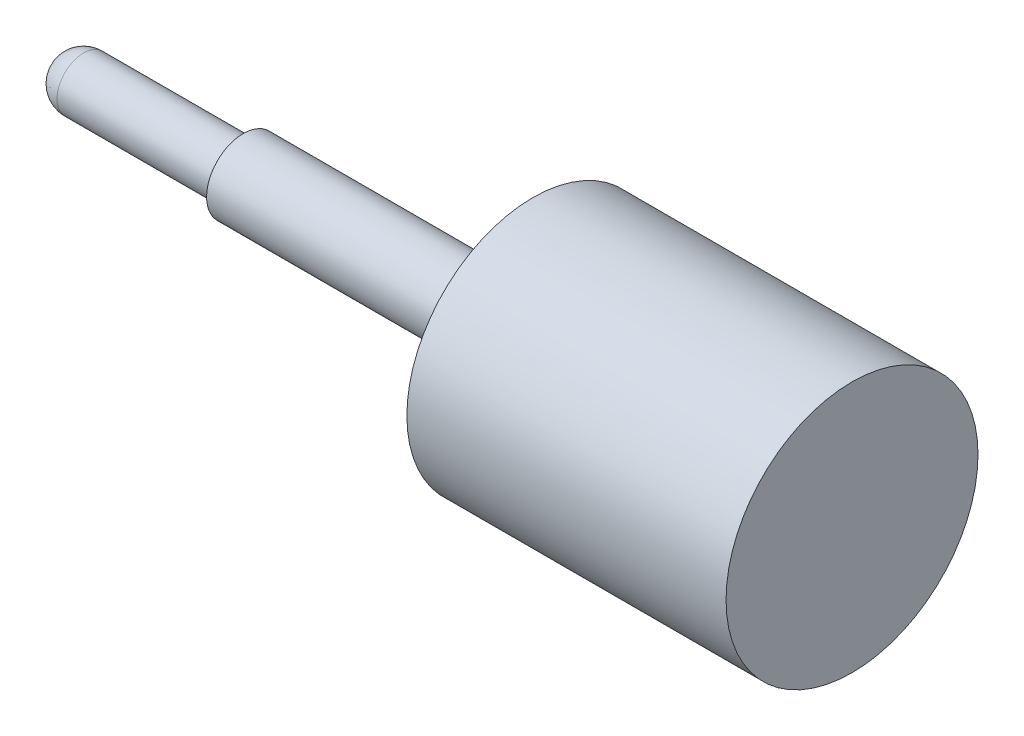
ISO-10303-21;
HEADER;
FILE_DESCRIPTION(('STEP AP214'),'2;1');
FILE_NAME('part.step','',(''),(''),'','','');
FILE_SCHEMA(('AUTOMOTIVE_DESIGN { 1 0 10303 214 1 1 1 1 }'));
ENDSEC;
DATA;
#1=APPLICATION_CONTEXT('core data for automotive mechanical design processes');
#2=APPLICATION_PROTOCOL_DEFINITION('international standard','automotive_design',2000,#1);
#3=PRODUCT_CONTEXT('',#1,'mechanical');
#4=PRODUCT('Part','Part','',(#3));
#5=PRODUCT_RELATED_PRODUCT_CATEGORY('part','',(#4));
#6=PRODUCT_DEFINITION_FORMATION('','',#4);
#7=PRODUCT_DEFINITION_CONTEXT('part definition',#1,'design');
#8=PRODUCT_DEFINITION('design','',#6,#7);
#9=PRODUCT_DEFINITION_SHAPE('','',#8);
#10=(LENGTH_UNIT() NAMED_UNIT(*) SI_UNIT(.MILLI.,.METRE.));
#11=(NAMED_UNIT(*) PLANE_ANGLE_UNIT() SI_UNIT($,.RADIAN.));
#12=(NAMED_UNIT(*) SI_UNIT($,.STERADIAN.) SOLID_ANGLE_UNIT());
#13=UNCERTAINTY_MEASURE_WITH_UNIT(LENGTH_MEASURE(1.E-05),#10,'distance_accuracy_value','');
#14=(GEOMETRIC_REPRESENTATION_CONTEXT(3) GLOBAL_UNCERTAINTY_ASSIGNED_CONTEXT((#13)) GLOBAL_UNIT_ASSIGNED_CONTEXT((#10,
#11,#12)) REPRESENTATION_CONTEXT('',''));
#15=CARTESIAN_POINT('',(0.,0.,0.));
#16=DIRECTION('',(0.,0.,1.));
#17=DIRECTION('',(1.,0.,0.));
#18=AXIS2_PLACEMENT_3D('',#15,#16,#17);
#19=CARTESIAN_POINT('',(-30.000000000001,-325.000000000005,0.));
#20=DIRECTION('',(0.,-1.,0.));
#21=DIRECTION('',(1.,0.,0.));
#22=AXIS2_PLACEMENT_3D('',#19,#20,#21);
#23=SPHERICAL_SURFACE('',#22,12.7);
#24=CARTESIAN_POINT('',(-30.000000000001,-325.000000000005,0.));
#25=DIRECTION('',(-1.,0.,0.));
#26=DIRECTION('',(0.,-1.,0.));
#27=AXIS2_PLACEMENT_3D('',#24,#25,#26);
#28=CIRCLE('',#27,12.7);
#29=CARTESIAN_POINT('',(-30.000000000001,-312.300000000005,0.));
#30=VERTEX_POINT('',#29);
#31=CARTESIAN_POINT('',(-30.000000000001,-337.700000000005,0.));
#32=VERTEX_POINT('',#31);
#33=EDGE_CURVE('E32',#30,#32,#28,.F.);
#34=ORIENTED_EDGE('',*,*,#33,.F.);
#35=CARTESIAN_POINT('',(-30.000000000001,-325.000000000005,0.));
#36=DIRECTION('',(-1.,0.,0.));
#37=DIRECTION('',(0.,-1.,0.));
#38=AXIS2_PLACEMENT_3D('',#35,#36,#37);
#39=CIRCLE('',#38,12.7);
#40=EDGE_CURVE('E35',#32,#30,#39,.F.);
#41=ORIENTED_EDGE('',*,*,#40,.F.);
#42=EDGE_LOOP('',(#34,#41));
#43=FACE_BOUND('',#42,.T.);
#44=ADVANCED_FACE('F16',(#43),#23,.T.);
#45=CARTESIAN_POINT('',(-42.700000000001,-325.000000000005,0.));
#46=DIRECTION('',(-1.,0.,0.));
#47=DIRECTION('',(0.,-1.,0.));
#48=AXIS2_PLACEMENT_3D('',#45,#46,#47);
#49=CYLINDRICAL_SURFACE('',#48,12.7);
#50=CARTESIAN_POINT('',(46.199999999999,-325.000000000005,0.));
#51=DIRECTION('',(-1.,0.,0.));
#52=DIRECTION('',(0.,-1.,0.));
#53=AXIS2_PLACEMENT_3D('',#50,#51,#52);
#54=CIRCLE('',#53,12.7);
#55=CARTESIAN_POINT('',(46.199999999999,-337.700000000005,0.));
#56=VERTEX_POINT('',#55);
#57=EDGE_CURVE('E20',#56,#56,#54,.F.);
#58=ORIENTED_EDGE('',*,*,#57,.F.);
#59=EDGE_LOOP('',(#58));
#60=FACE_BOUND('',#59,.T.);
#61=ORIENTED_EDGE('',*,*,#40,.T.);
#62=ORIENTED_EDGE('',*,*,#33,.T.);
#63=EDGE_LOOP('',(#61,#62));
#64=FACE_BOUND('',#63,.T.);
#65=ADVANCED_FACE('F37',(#60,#64),#49,.T.);
#66=CARTESIAN_POINT('',(46.199999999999,-337.700000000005,0.));
#67=DIRECTION('',(-1.,0.,0.));
#68=DIRECTION('',(0.,-1.,0.));
#69=AXIS2_PLACEMENT_3D('',#66,#67,#68);
#70=PLANE('',#69);
#71=ORIENTED_EDGE('',*,*,#57,.T.);
#72=EDGE_LOOP('',(#71));
#73=FACE_BOUND('',#72,.T.);
#74=CARTESIAN_POINT('',(46.199999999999,-325.000000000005,0.));
#75=DIRECTION('',(-1.,0.,0.));
#76=DIRECTION('',(0.,-1.,0.));
#77=AXIS2_PLACEMENT_3D('',#74,#75,#76);
#78=CIRCLE('',#77,17.4752);
#79=CARTESIAN_POINT('',(46.199999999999,-342.475200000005,0.));
#80=VERTEX_POINT('',#79);
#81=EDGE_CURVE('E40',#80,#80,#78,.F.);
#82=ORIENTED_EDGE('',*,*,#81,.F.);
#83=EDGE_LOOP('',(#82));
#84=FACE_BOUND('',#83,.T.);
#85=ADVANCED_FACE('F56',(#73,#84),#70,.T.);
#86=CARTESIAN_POINT('',(-42.700000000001,-325.000000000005,0.));
#87=DIRECTION('',(-1.,0.,0.));
#88=DIRECTION('',(0.,-1.,0.));
#89=AXIS2_PLACEMENT_3D('',#86,#87,#88);
#90=CYLINDRICAL_SURFACE('',#89,17.4752);
#91=ORIENTED_EDGE('',*,*,#81,.T.);
#92=EDGE_LOOP('',(#91));
#93=FACE_BOUND('',#92,.T.);
#94=CARTESIAN_POINT('',(184.5,-325.000000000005,0.));
#95=DIRECTION('',(-1.,0.,0.));
#96=DIRECTION('',(0.,-1.,0.));
#97=AXIS2_PLACEMENT_3D('',#94,#95,#96);
#98=CIRCLE('',#97,17.4752);
#99=CARTESIAN_POINT('',(184.5,-342.475200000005,0.));
#100=VERTEX_POINT('',#99);
#101=EDGE_CURVE('E48',#100,#100,#98,.T.);
#102=ORIENTED_EDGE('',*,*,#101,.T.);
#103=EDGE_LOOP('',(#102));
#104=FACE_BOUND('',#103,.T.);
#105=ADVANCED_FACE('F53',(#93,#104),#90,.T.);
#106=CARTESIAN_POINT('',(336.9,-325.000000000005,0.));
#107=DIRECTION('',(1.,0.,0.));
#108=DIRECTION('',(0.,1.,0.));
#109=AXIS2_PLACEMENT_3D('',#106,#107,#108);
#110=PLANE('',#109);
#111=CARTESIAN_POINT('',(336.9,-325.000000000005,0.));
#112=DIRECTION('',(-1.,0.,0.));
#113=DIRECTION('',(0.,-1.,0.));
#114=AXIS2_PLACEMENT_3D('',#111,#112,#113);
#115=CIRCLE('',#114,60.1483840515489);
#116=CARTESIAN_POINT('',(336.9,-385.148384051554,0.));
#117=VERTEX_POINT('',#116);
#118=EDGE_CURVE('E26',#117,#117,#115,.T.);
#119=ORIENTED_EDGE('',*,*,#118,.F.);
#120=EDGE_LOOP('',(#119));
#121=FACE_BOUND('',#120,.T.);
#122=ADVANCED_FACE('F65',(#121),#110,.T.);
#123=CARTESIAN_POINT('',(184.5,-325.000000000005,0.));
#124=DIRECTION('',(1.,0.,0.));
#125=DIRECTION('',(0.,1.,0.));
#126=AXIS2_PLACEMENT_3D('',#123,#124,#125);
#127=PLANE('',#126);
#128=CARTESIAN_POINT('',(184.5,-325.000000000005,0.));
#129=DIRECTION('',(-1.,0.,0.));
#130=DIRECTION('',(0.,-1.,0.));
#131=AXIS2_PLACEMENT_3D('',#128,#129,#130);
#132=CIRCLE('',#131,60.1483840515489);
#133=CARTESIAN_POINT('',(184.5,-385.148384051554,0.));
#134=VERTEX_POINT('',#133);
#135=EDGE_CURVE('E11',#134,#134,#132,.F.);
#136=ORIENTED_EDGE('',*,*,#135,.F.);
#137=EDGE_LOOP('',(#136));
#138=FACE_BOUND('',#137,.T.);
#139=ORIENTED_EDGE('',*,*,#101,.F.);
#140=EDGE_LOOP('',(#139));
#141=FACE_BOUND('',#140,.T.);
#142=ADVANCED_FACE('F70',(#138,#141),#127,.F.);
#143=CARTESIAN_POINT('',(336.9,-325.000000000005,0.));
#144=DIRECTION('',(-1.,0.,0.));
#145=DIRECTION('',(0.,-1.,0.));
#146=AXIS2_PLACEMENT_3D('',#143,#144,#145);
#147=CYLINDRICAL_SURFACE('',#146,60.1483840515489);
#148=ORIENTED_EDGE('',*,*,#118,.T.);
#149=EDGE_LOOP('',(#148));
#150=FACE_BOUND('',#149,.T.);
#151=ORIENTED_EDGE('',*,*,#135,.T.);
#152=EDGE_LOOP('',(#151));
#153=FACE_BOUND('',#152,.T.);
#154=ADVANCED_FACE('F68',(#150,#153),#147,.T.);
#155=CLOSED_SHELL('',(#44,#65,#85,#105,#122,#142,#154));
#156=MANIFOLD_SOLID_BREP('B1',#155);
#157=ADVANCED_BREP_SHAPE_REPRESENTATION('',(#18,#156),#14);
#158=SHAPE_DEFINITION_REPRESENTATION(#9,#157);
ENDSEC;
END-ISO-10303-21;
